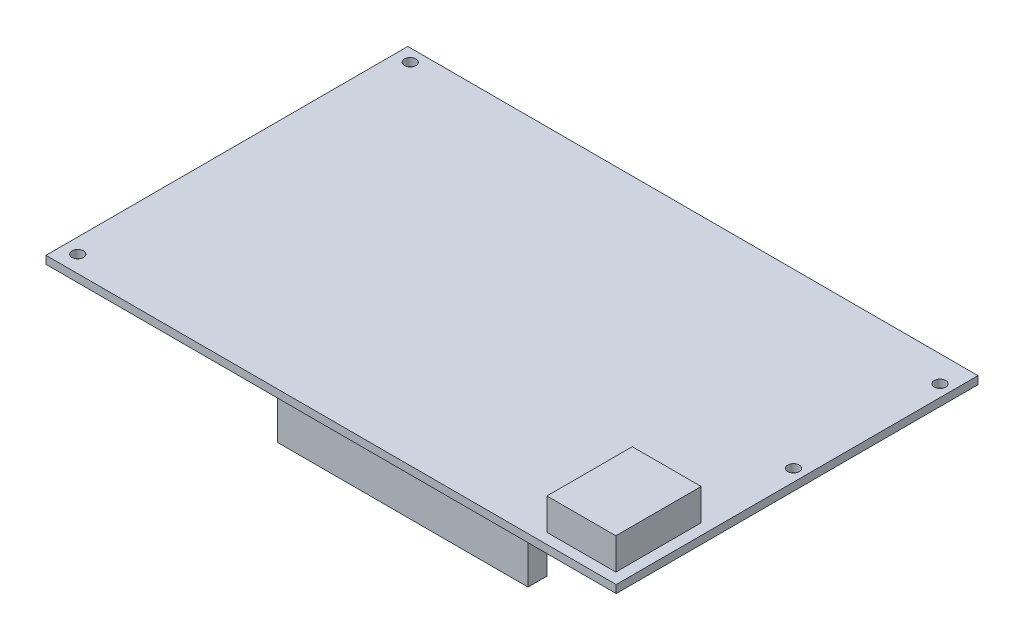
from build123d import *

# Parameters (mm, degrees)
SKETCH1_W      = 145.9357
SKETCH1_H      = 92.5957
SKETCH1_R      = 1.4732
EXTRUDE1_DEPTH = 2.0066
SKETCH2_W      = 17.6403
SKETCH2_H      = 21.844
EXTRUDE2_DEPTH = 8.0518
SKETCH3_W      = 64.0842
SKETCH3_H      = 4.8387
EXTRUDE3_DEPTH = 11.2395


with BuildPart() as part:
    # Sketch1 → Extrude1 (new body)
    with BuildSketch(Plane(origin=(0, 0, 0), x_dir=(1, 0, 0), z_dir=(0, 1, 0))):
        with Locations((72.96785, 46.29785)):
            Rectangle(SKETCH1_W, SKETCH1_H)
        with Locations(Location((3.81, 89.408, 0), (0, 0, 270))):
            Circle(SKETCH1_R, mode=Mode.SUBTRACT)
        with Locations(Location((3.81, 4.318, 0), (0, 0, 270))):
            Circle(SKETCH1_R, mode=Mode.SUBTRACT)
        with Locations(Location((142.875, 85.9155, 0), (0, 0, 270))):
            Circle(SKETCH1_R, mode=Mode.SUBTRACT)
        with Locations(Location((142.875, 48.4505, 0), (0, 0, 270))):
            Circle(SKETCH1_R, mode=Mode.SUBTRACT)
    extrude(amount=EXTRUDE1_DEPTH)

    # Sketch2 → Extrude2 (add)
    with BuildSketch(Plane(origin=(0, 2.0066, 0), x_dir=(-1, 0, 0), z_dir=(0, 1, 0))):
        with Locations((-134.30885, -13.6271)):
            Rectangle(SKETCH2_W, SKETCH2_H)
    extrude(amount=EXTRUDE2_DEPTH)

    # Sketch3 → Extrude3 (add)
    with BuildSketch(Plane.XZ):
        with Locations((89.9287, -3.81635)):
            Rectangle(SKETCH3_W, SKETCH3_H)
    extrude(amount=EXTRUDE3_DEPTH)


solid = part.part
